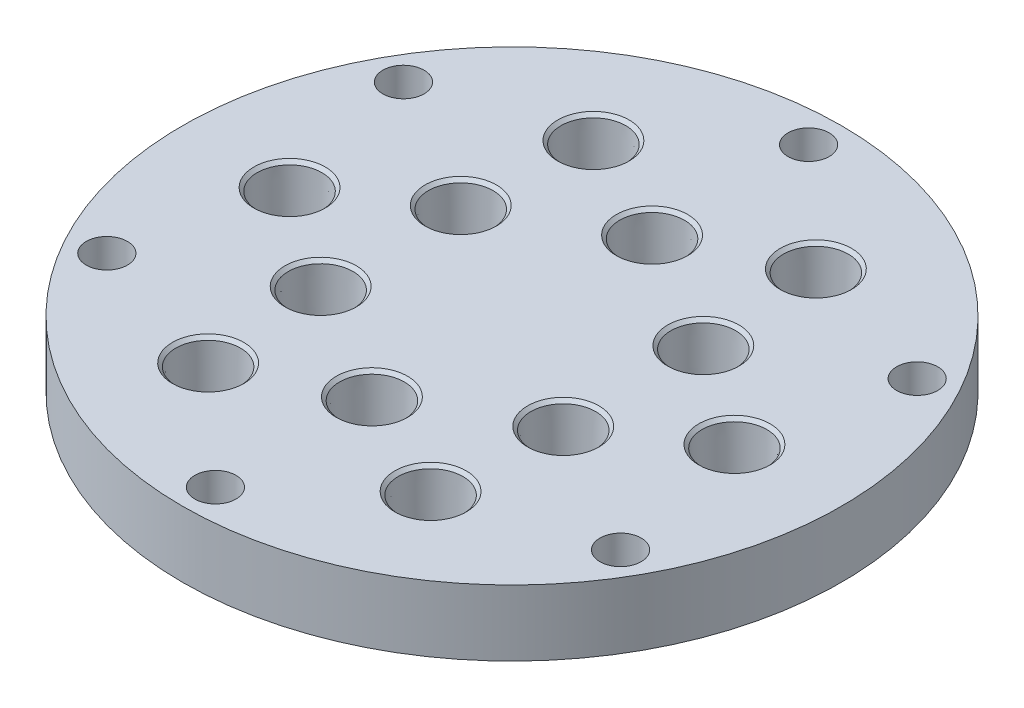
ISO-10303-21;
HEADER;
FILE_DESCRIPTION(('STEP AP214'),'2;1');
FILE_NAME('part.step','',(''),(''),'','','');
FILE_SCHEMA(('AUTOMOTIVE_DESIGN { 1 0 10303 214 1 1 1 1 }'));
ENDSEC;
DATA;
#1=APPLICATION_CONTEXT('core data for automotive mechanical design processes');
#2=APPLICATION_PROTOCOL_DEFINITION('international standard','automotive_design',2000,#1);
#3=PRODUCT_CONTEXT('',#1,'mechanical');
#4=PRODUCT('Part','Part','',(#3));
#5=PRODUCT_RELATED_PRODUCT_CATEGORY('part','',(#4));
#6=PRODUCT_DEFINITION_FORMATION('','',#4);
#7=PRODUCT_DEFINITION_CONTEXT('part definition',#1,'design');
#8=PRODUCT_DEFINITION('design','',#6,#7);
#9=PRODUCT_DEFINITION_SHAPE('','',#8);
#10=(LENGTH_UNIT() NAMED_UNIT(*) SI_UNIT(.MILLI.,.METRE.));
#11=(NAMED_UNIT(*) PLANE_ANGLE_UNIT() SI_UNIT($,.RADIAN.));
#12=(NAMED_UNIT(*) SI_UNIT($,.STERADIAN.) SOLID_ANGLE_UNIT());
#13=UNCERTAINTY_MEASURE_WITH_UNIT(LENGTH_MEASURE(1.E-05),#10,'distance_accuracy_value','');
#14=(GEOMETRIC_REPRESENTATION_CONTEXT(3) GLOBAL_UNCERTAINTY_ASSIGNED_CONTEXT((#13)) GLOBAL_UNIT_ASSIGNED_CONTEXT((#10,
#11,#12)) REPRESENTATION_CONTEXT('',''));
#15=CARTESIAN_POINT('',(0.,0.,0.));
#16=DIRECTION('',(0.,0.,1.));
#17=DIRECTION('',(1.,0.,0.));
#18=AXIS2_PLACEMENT_3D('',#15,#16,#17);
#19=CARTESIAN_POINT('',(0.,0.,0.));
#20=DIRECTION('',(0.,1.,0.));
#21=DIRECTION('',(0.,0.,1.));
#22=AXIS2_PLACEMENT_3D('',#19,#20,#21);
#23=PLANE('',#22);
#24=CARTESIAN_POINT('',(21.4312500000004,0.,37.1200138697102));
#25=DIRECTION('',(0.,1.,0.));
#26=DIRECTION('',(-0.866025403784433,0.,0.50000000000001));
#27=AXIS2_PLACEMENT_3D('',#24,#25,#26);
#28=CIRCLE('',#27,5.5626);
#29=CARTESIAN_POINT('',(16.6138970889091,0.,39.9013138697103));
#30=VERTEX_POINT('',#29);
#31=EDGE_CURVE('E306',#30,#30,#28,.T.);
#32=ORIENTED_EDGE('',*,*,#31,.T.);
#33=EDGE_LOOP('',(#32));
#34=FACE_BOUND('',#33,.T.);
#35=CARTESIAN_POINT('',(-21.4312499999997,0.,37.1200138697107));
#36=DIRECTION('',(0.,1.,0.));
#37=DIRECTION('',(-0.866025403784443,0.,-0.499999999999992));
#38=AXIS2_PLACEMENT_3D('',#35,#36,#37);
#39=CIRCLE('',#38,5.5626);
#40=CARTESIAN_POINT('',(-26.248602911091,0.,34.3387138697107));
#41=VERTEX_POINT('',#40);
#42=EDGE_CURVE('E321',#41,#41,#39,.T.);
#43=ORIENTED_EDGE('',*,*,#42,.T.);
#44=EDGE_LOOP('',(#43));
#45=FACE_BOUND('',#44,.T.);
#46=CARTESIAN_POINT('',(-42.8625,0.,2.99307411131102E-13));
#47=DIRECTION('',(0.,1.,0.));
#48=DIRECTION('',(0.,0.,-1.));
#49=AXIS2_PLACEMENT_3D('',#46,#47,#48);
#50=CIRCLE('',#49,5.5626);
#51=CARTESIAN_POINT('',(-42.8625,0.,-5.5625999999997));
#52=VERTEX_POINT('',#51);
#53=EDGE_CURVE('E336',#52,#52,#50,.T.);
#54=ORIENTED_EDGE('',*,*,#53,.T.);
#55=EDGE_LOOP('',(#54));
#56=FACE_BOUND('',#55,.T.);
#57=CARTESIAN_POINT('',(-21.4312500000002,0.,-37.1200138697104));
#58=DIRECTION('',(0.,1.,0.));
#59=DIRECTION('',(0.866025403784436,0.,-0.500000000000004));
#60=AXIS2_PLACEMENT_3D('',#57,#58,#59);
#61=CIRCLE('',#60,5.5626);
#62=CARTESIAN_POINT('',(-16.6138970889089,0.,-39.9013138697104));
#63=VERTEX_POINT('',#62);
#64=EDGE_CURVE('E351',#63,#63,#61,.T.);
#65=ORIENTED_EDGE('',*,*,#64,.T.);
#66=EDGE_LOOP('',(#65));
#67=FACE_BOUND('',#66,.T.);
#68=CARTESIAN_POINT('',(21.4312499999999,0.,-37.1200138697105));
#69=DIRECTION('',(0.,1.,0.));
#70=DIRECTION('',(0.86602540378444,0.,0.499999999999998));
#71=AXIS2_PLACEMENT_3D('',#68,#69,#70);
#72=CIRCLE('',#71,5.5626);
#73=CARTESIAN_POINT('',(26.2486029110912,0.,-34.3387138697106));
#74=VERTEX_POINT('',#73);
#75=EDGE_CURVE('E366',#74,#74,#72,.T.);
#76=ORIENTED_EDGE('',*,*,#75,.T.);
#77=EDGE_LOOP('',(#76));
#78=FACE_BOUND('',#77,.T.);
#79=CARTESIAN_POINT('',(-23.3718605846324,0.,13.4937500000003));
#80=DIRECTION('',(0.,1.,0.));
#81=DIRECTION('',(-0.866025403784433,0.,0.50000000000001));
#82=AXIS2_PLACEMENT_3D('',#79,#80,#81);
#83=CIRCLE('',#82,5.5626);
#84=CARTESIAN_POINT('',(-28.1892134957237,0.,16.2750500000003));
#85=VERTEX_POINT('',#84);
#86=EDGE_CURVE('E381',#85,#85,#83,.T.);
#87=ORIENTED_EDGE('',*,*,#86,.T.);
#88=EDGE_LOOP('',(#87));
#89=FACE_BOUND('',#88,.T.);
#90=CARTESIAN_POINT('',(-23.3718605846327,0.,-13.4937499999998));
#91=DIRECTION('',(0.,1.,0.));
#92=DIRECTION('',(-0.866025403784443,0.,-0.499999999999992));
#93=AXIS2_PLACEMENT_3D('',#90,#91,#92);
#94=CIRCLE('',#93,5.5626);
#95=CARTESIAN_POINT('',(-28.189213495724,0.,-16.2750499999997));
#96=VERTEX_POINT('',#95);
#97=EDGE_CURVE('E396',#96,#96,#94,.T.);
#98=ORIENTED_EDGE('',*,*,#97,.T.);
#99=EDGE_LOOP('',(#98));
#100=FACE_BOUND('',#99,.T.);
#101=CARTESIAN_POINT('',(-1.88452814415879E-13,0.,-26.9875));
#102=DIRECTION('',(0.,1.,0.));
#103=DIRECTION('',(0.,0.,-1.));
#104=AXIS2_PLACEMENT_3D('',#101,#102,#103);
#105=CIRCLE('',#104,5.5626);
#106=CARTESIAN_POINT('',(-2.27296265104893E-13,0.,-32.5501));
#107=VERTEX_POINT('',#106);
#108=EDGE_CURVE('E411',#107,#107,#105,.T.);
#109=ORIENTED_EDGE('',*,*,#108,.T.);
#110=EDGE_LOOP('',(#109));
#111=FACE_BOUND('',#110,.T.);
#112=CARTESIAN_POINT('',(23.3718605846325,0.,-13.4937500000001));
#113=DIRECTION('',(0.,1.,0.));
#114=DIRECTION('',(0.866025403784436,0.,-0.500000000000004));
#115=AXIS2_PLACEMENT_3D('',#112,#113,#114);
#116=CIRCLE('',#115,5.5626);
#117=CARTESIAN_POINT('',(28.1892134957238,0.,-16.2750500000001));
#118=VERTEX_POINT('',#117);
#119=EDGE_CURVE('E426',#118,#118,#116,.T.);
#120=ORIENTED_EDGE('',*,*,#119,.T.);
#121=EDGE_LOOP('',(#120));
#122=FACE_BOUND('',#121,.T.);
#123=CARTESIAN_POINT('',(23.3718605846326,0.,13.4937499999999));
#124=DIRECTION('',(0.,1.,0.));
#125=DIRECTION('',(0.86602540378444,0.,0.499999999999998));
#126=AXIS2_PLACEMENT_3D('',#123,#124,#125);
#127=CIRCLE('',#126,5.5626);
#128=CARTESIAN_POINT('',(28.1892134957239,0.,16.2750499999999));
#129=VERTEX_POINT('',#128);
#130=EDGE_CURVE('E441',#129,#129,#127,.T.);
#131=ORIENTED_EDGE('',*,*,#130,.T.);
#132=EDGE_LOOP('',(#131));
#133=FACE_BOUND('',#132,.T.);
#134=CARTESIAN_POINT('',(-49.4933518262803,0.,28.5750000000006));
#135=DIRECTION('',(0.,1.,0.));
#136=DIRECTION('',(-0.866025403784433,0.,0.50000000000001));
#137=AXIS2_PLACEMENT_3D('',#134,#135,#136);
#138=CIRCLE('',#137,3.96875);
#139=CARTESIAN_POINT('',(-52.9303901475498,0.,30.5593750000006));
#140=VERTEX_POINT('',#139);
#141=EDGE_CURVE('E453',#140,#140,#138,.T.);
#142=ORIENTED_EDGE('',*,*,#141,.T.);
#143=EDGE_LOOP('',(#142));
#144=FACE_BOUND('',#143,.T.);
#145=CARTESIAN_POINT('',(-49.4933518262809,0.,-28.5749999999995));
#146=DIRECTION('',(0.,1.,0.));
#147=DIRECTION('',(-0.866025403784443,0.,-0.499999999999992));
#148=AXIS2_PLACEMENT_3D('',#145,#146,#147);
#149=CIRCLE('',#148,3.96875);
#150=CARTESIAN_POINT('',(-52.9303901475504,0.,-30.5593749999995));
#151=VERTEX_POINT('',#150);
#152=EDGE_CURVE('E459',#151,#151,#149,.T.);
#153=ORIENTED_EDGE('',*,*,#152,.T.);
#154=EDGE_LOOP('',(#153));
#155=FACE_BOUND('',#154,.T.);
#156=CARTESIAN_POINT('',(-3.99076548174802E-13,0.,-57.15));
#157=DIRECTION('',(0.,1.,0.));
#158=DIRECTION('',(0.,0.,-1.));
#159=AXIS2_PLACEMENT_3D('',#156,#157,#158);
#160=CIRCLE('',#159,3.96875);
#161=CARTESIAN_POINT('',(-4.26790197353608E-13,0.,-61.11875));
#162=VERTEX_POINT('',#161);
#163=EDGE_CURVE('E465',#162,#162,#160,.T.);
#164=ORIENTED_EDGE('',*,*,#163,.T.);
#165=EDGE_LOOP('',(#164));
#166=FACE_BOUND('',#165,.T.);
#167=CARTESIAN_POINT('',(49.4933518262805,0.,-28.5750000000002));
#168=DIRECTION('',(0.,1.,0.));
#169=DIRECTION('',(0.866025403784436,0.,-0.500000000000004));
#170=AXIS2_PLACEMENT_3D('',#167,#168,#169);
#171=CIRCLE('',#170,3.96875);
#172=CARTESIAN_POINT('',(52.93039014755,0.,-30.5593750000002));
#173=VERTEX_POINT('',#172);
#174=EDGE_CURVE('E471',#173,#173,#171,.T.);
#175=ORIENTED_EDGE('',*,*,#174,.T.);
#176=EDGE_LOOP('',(#175));
#177=FACE_BOUND('',#176,.T.);
#178=CARTESIAN_POINT('',(49.4933518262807,0.,28.5749999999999));
#179=DIRECTION('',(0.,1.,0.));
#180=DIRECTION('',(0.86602540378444,0.,0.499999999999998));
#181=AXIS2_PLACEMENT_3D('',#178,#179,#180);
#182=CIRCLE('',#181,3.96875);
#183=CARTESIAN_POINT('',(52.9303901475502,0.,30.5593749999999));
#184=VERTEX_POINT('',#183);
#185=EDGE_CURVE('E477',#184,#184,#182,.T.);
#186=ORIENTED_EDGE('',*,*,#185,.T.);
#187=EDGE_LOOP('',(#186));
#188=FACE_BOUND('',#187,.T.);
#189=CARTESIAN_POINT('',(0.,0.,26.9875));
#190=DIRECTION('',(0.,1.,0.));
#191=DIRECTION('',(0.,0.,1.));
#192=AXIS2_PLACEMENT_3D('',#189,#190,#191);
#193=CIRCLE('',#192,5.5626);
#194=CARTESIAN_POINT('',(0.,0.,32.5501));
#195=VERTEX_POINT('',#194);
#196=EDGE_CURVE('E33',#195,#195,#193,.T.);
#197=ORIENTED_EDGE('',*,*,#196,.T.);
#198=EDGE_LOOP('',(#197));
#199=FACE_BOUND('',#198,.T.);
#200=CARTESIAN_POINT('',(42.8625,0.,0.));
#201=DIRECTION('',(0.,1.,0.));
#202=DIRECTION('',(0.,0.,1.));
#203=AXIS2_PLACEMENT_3D('',#200,#201,#202);
#204=CIRCLE('',#203,5.5626);
#205=CARTESIAN_POINT('',(42.8625,0.,5.5626));
#206=VERTEX_POINT('',#205);
#207=EDGE_CURVE('E45',#206,#206,#204,.T.);
#208=ORIENTED_EDGE('',*,*,#207,.T.);
#209=EDGE_LOOP('',(#208));
#210=FACE_BOUND('',#209,.T.);
#211=CARTESIAN_POINT('',(0.,0.,57.15));
#212=DIRECTION('',(0.,1.,0.));
#213=DIRECTION('',(0.,0.,1.));
#214=AXIS2_PLACEMENT_3D('',#211,#212,#213);
#215=CIRCLE('',#214,3.96875);
#216=CARTESIAN_POINT('',(0.,0.,61.11875));
#217=VERTEX_POINT('',#216);
#218=EDGE_CURVE('E42',#217,#217,#215,.T.);
#219=ORIENTED_EDGE('',*,*,#218,.T.);
#220=EDGE_LOOP('',(#219));
#221=FACE_BOUND('',#220,.T.);
#222=CARTESIAN_POINT('',(0.,0.,0.));
#223=DIRECTION('',(0.,1.,0.));
#224=DIRECTION('',(0.,0.,1.));
#225=AXIS2_PLACEMENT_3D('',#222,#223,#224);
#226=CIRCLE('',#225,63.5);
#227=CARTESIAN_POINT('',(0.,0.,63.5));
#228=VERTEX_POINT('',#227);
#229=EDGE_CURVE('E10',#228,#228,#226,.T.);
#230=ORIENTED_EDGE('',*,*,#229,.F.);
#231=EDGE_LOOP('',(#230));
#232=FACE_BOUND('',#231,.T.);
#233=ADVANCED_FACE('F30',(#34,#45,#56,#67,#78,#89,#100,#111,#122,#133,#144,#155,#166,#177,#188,
#199,#210,#221,#232),#23,.F.);
#234=CARTESIAN_POINT('',(0.,0.,0.));
#235=DIRECTION('',(0.,1.,0.));
#236=DIRECTION('',(0.,0.,1.));
#237=AXIS2_PLACEMENT_3D('',#234,#235,#236);
#238=CYLINDRICAL_SURFACE('',#237,63.5);
#239=CARTESIAN_POINT('',(0.,12.7,0.));
#240=DIRECTION('',(0.,1.,0.));
#241=DIRECTION('',(0.,0.,1.));
#242=AXIS2_PLACEMENT_3D('',#239,#240,#241);
#243=CIRCLE('',#242,63.5);
#244=CARTESIAN_POINT('',(0.,12.7,63.5));
#245=VERTEX_POINT('',#244);
#246=EDGE_CURVE('E37',#245,#245,#243,.T.);
#247=ORIENTED_EDGE('',*,*,#246,.F.);
#248=EDGE_LOOP('',(#247));
#249=FACE_BOUND('',#248,.T.);
#250=ORIENTED_EDGE('',*,*,#229,.T.);
#251=EDGE_LOOP('',(#250));
#252=FACE_BOUND('',#251,.T.);
#253=ADVANCED_FACE('F77',(#249,#252),#238,.T.);
#254=CARTESIAN_POINT('',(63.5,12.7,0.));
#255=DIRECTION('',(0.,-1.,0.));
#256=DIRECTION('',(0.,0.,-1.));
#257=AXIS2_PLACEMENT_3D('',#254,#255,#256);
#258=PLANE('',#257);
#259=CARTESIAN_POINT('',(21.4312500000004,12.7,37.1200138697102));
#260=DIRECTION('',(0.,1.,0.));
#261=DIRECTION('',(-0.866025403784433,0.,0.50000000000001));
#262=AXIS2_PLACEMENT_3D('',#259,#260,#261);
#263=CIRCLE('',#262,6.8752847);
#264=CARTESIAN_POINT('',(15.47707879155,12.7,40.5576562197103));
#265=VERTEX_POINT('',#264);
#266=EDGE_CURVE('E305',#265,#265,#263,.T.);
#267=ORIENTED_EDGE('',*,*,#266,.F.);
#268=EDGE_LOOP('',(#267));
#269=FACE_BOUND('',#268,.T.);
#270=CARTESIAN_POINT('',(-21.4312499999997,12.7,37.1200138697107));
#271=DIRECTION('',(0.,1.,0.));
#272=DIRECTION('',(-0.866025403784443,0.,-0.499999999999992));
#273=AXIS2_PLACEMENT_3D('',#270,#271,#272);
#274=CIRCLE('',#273,6.8752847);
#275=CARTESIAN_POINT('',(-27.3854212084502,12.7,33.6823715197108));
#276=VERTEX_POINT('',#275);
#277=EDGE_CURVE('E318',#276,#276,#274,.T.);
#278=ORIENTED_EDGE('',*,*,#277,.F.);
#279=EDGE_LOOP('',(#278));
#280=FACE_BOUND('',#279,.T.);
#281=CARTESIAN_POINT('',(-42.8625,12.7,2.99307411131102E-13));
#282=DIRECTION('',(0.,1.,0.));
#283=DIRECTION('',(0.,0.,-1.));
#284=AXIS2_PLACEMENT_3D('',#281,#282,#283);
#285=CIRCLE('',#284,6.8752847);
#286=CARTESIAN_POINT('',(-42.8625,12.7,-6.8752846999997));
#287=VERTEX_POINT('',#286);
#288=EDGE_CURVE('E333',#287,#287,#285,.T.);
#289=ORIENTED_EDGE('',*,*,#288,.F.);
#290=EDGE_LOOP('',(#289));
#291=FACE_BOUND('',#290,.T.);
#292=CARTESIAN_POINT('',(-21.4312500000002,12.7,-37.1200138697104));
#293=DIRECTION('',(0.,1.,0.));
#294=DIRECTION('',(0.866025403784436,0.,-0.500000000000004));
#295=AXIS2_PLACEMENT_3D('',#292,#293,#294);
#296=CIRCLE('',#295,6.8752847);
#297=CARTESIAN_POINT('',(-15.4770787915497,12.7,-40.5576562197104));
#298=VERTEX_POINT('',#297);
#299=EDGE_CURVE('E348',#298,#298,#296,.T.);
#300=ORIENTED_EDGE('',*,*,#299,.F.);
#301=EDGE_LOOP('',(#300));
#302=FACE_BOUND('',#301,.T.);
#303=CARTESIAN_POINT('',(21.4312499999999,12.7,-37.1200138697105));
#304=DIRECTION('',(0.,1.,0.));
#305=DIRECTION('',(0.86602540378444,0.,0.499999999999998));
#306=AXIS2_PLACEMENT_3D('',#303,#304,#305);
#307=CIRCLE('',#306,6.8752847);
#308=CARTESIAN_POINT('',(27.3854212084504,12.7,-33.6823715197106));
#309=VERTEX_POINT('',#308);
#310=EDGE_CURVE('E363',#309,#309,#307,.T.);
#311=ORIENTED_EDGE('',*,*,#310,.F.);
#312=EDGE_LOOP('',(#311));
#313=FACE_BOUND('',#312,.T.);
#314=CARTESIAN_POINT('',(-23.3718605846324,12.7,13.4937500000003));
#315=DIRECTION('',(0.,1.,0.));
#316=DIRECTION('',(-0.866025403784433,0.,0.50000000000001));
#317=AXIS2_PLACEMENT_3D('',#314,#315,#316);
#318=CIRCLE('',#317,6.8752847);
#319=CARTESIAN_POINT('',(-29.3260317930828,12.7,16.9313923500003));
#320=VERTEX_POINT('',#319);
#321=EDGE_CURVE('E378',#320,#320,#318,.T.);
#322=ORIENTED_EDGE('',*,*,#321,.F.);
#323=EDGE_LOOP('',(#322));
#324=FACE_BOUND('',#323,.T.);
#325=CARTESIAN_POINT('',(-23.3718605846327,12.7,-13.4937499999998));
#326=DIRECTION('',(0.,1.,0.));
#327=DIRECTION('',(-0.866025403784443,0.,-0.499999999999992));
#328=AXIS2_PLACEMENT_3D('',#325,#326,#327);
#329=CIRCLE('',#328,6.8752847);
#330=CARTESIAN_POINT('',(-29.3260317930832,12.7,-16.9313923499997));
#331=VERTEX_POINT('',#330);
#332=EDGE_CURVE('E393',#331,#331,#329,.T.);
#333=ORIENTED_EDGE('',*,*,#332,.F.);
#334=EDGE_LOOP('',(#333));
#335=FACE_BOUND('',#334,.T.);
#336=CARTESIAN_POINT('',(-1.88452814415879E-13,12.7,-26.9875));
#337=DIRECTION('',(0.,1.,0.));
#338=DIRECTION('',(0.,0.,-1.));
#339=AXIS2_PLACEMENT_3D('',#336,#337,#338);
#340=CIRCLE('',#339,6.8752847);
#341=CARTESIAN_POINT('',(-2.36462698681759E-13,12.7,-33.8627847));
#342=VERTEX_POINT('',#341);
#343=EDGE_CURVE('E408',#342,#342,#340,.T.);
#344=ORIENTED_EDGE('',*,*,#343,.F.);
#345=EDGE_LOOP('',(#344));
#346=FACE_BOUND('',#345,.T.);
#347=CARTESIAN_POINT('',(23.3718605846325,12.7,-13.4937500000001));
#348=DIRECTION('',(0.,1.,0.));
#349=DIRECTION('',(0.866025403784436,0.,-0.500000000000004));
#350=AXIS2_PLACEMENT_3D('',#347,#348,#349);
#351=CIRCLE('',#350,6.8752847);
#352=CARTESIAN_POINT('',(29.3260317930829,12.7,-16.9313923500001));
#353=VERTEX_POINT('',#352);
#354=EDGE_CURVE('E423',#353,#353,#351,.T.);
#355=ORIENTED_EDGE('',*,*,#354,.F.);
#356=EDGE_LOOP('',(#355));
#357=FACE_BOUND('',#356,.T.);
#358=CARTESIAN_POINT('',(23.3718605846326,12.7,13.4937499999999));
#359=DIRECTION('',(0.,1.,0.));
#360=DIRECTION('',(0.86602540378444,0.,0.499999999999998));
#361=AXIS2_PLACEMENT_3D('',#358,#359,#360);
#362=CIRCLE('',#361,6.8752847);
#363=CARTESIAN_POINT('',(29.326031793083,12.7,16.9313923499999));
#364=VERTEX_POINT('',#363);
#365=EDGE_CURVE('E438',#364,#364,#362,.T.);
#366=ORIENTED_EDGE('',*,*,#365,.F.);
#367=EDGE_LOOP('',(#366));
#368=FACE_BOUND('',#367,.T.);
#369=CARTESIAN_POINT('',(-49.4933518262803,12.7,28.5750000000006));
#370=DIRECTION('',(0.,1.,0.));
#371=DIRECTION('',(-0.866025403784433,0.,0.50000000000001));
#372=AXIS2_PLACEMENT_3D('',#369,#370,#371);
#373=CIRCLE('',#372,3.96874999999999);
#374=CARTESIAN_POINT('',(-52.9303901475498,12.7,30.5593750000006));
#375=VERTEX_POINT('',#374);
#376=EDGE_CURVE('E456',#375,#375,#373,.T.);
#377=ORIENTED_EDGE('',*,*,#376,.F.);
#378=EDGE_LOOP('',(#377));
#379=FACE_BOUND('',#378,.T.);
#380=CARTESIAN_POINT('',(-49.4933518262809,12.7,-28.5749999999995));
#381=DIRECTION('',(0.,1.,0.));
#382=DIRECTION('',(-0.866025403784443,0.,-0.499999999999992));
#383=AXIS2_PLACEMENT_3D('',#380,#381,#382);
#384=CIRCLE('',#383,3.96874999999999);
#385=CARTESIAN_POINT('',(-52.9303901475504,12.7,-30.5593749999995));
#386=VERTEX_POINT('',#385);
#387=EDGE_CURVE('E462',#386,#386,#384,.T.);
#388=ORIENTED_EDGE('',*,*,#387,.F.);
#389=EDGE_LOOP('',(#388));
#390=FACE_BOUND('',#389,.T.);
#391=CARTESIAN_POINT('',(-3.99076548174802E-13,12.7,-57.15));
#392=DIRECTION('',(0.,1.,0.));
#393=DIRECTION('',(0.,0.,-1.));
#394=AXIS2_PLACEMENT_3D('',#391,#392,#393);
#395=CIRCLE('',#394,3.96874999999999);
#396=CARTESIAN_POINT('',(-4.26790197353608E-13,12.7,-61.11875));
#397=VERTEX_POINT('',#396);
#398=EDGE_CURVE('E468',#397,#397,#395,.T.);
#399=ORIENTED_EDGE('',*,*,#398,.F.);
#400=EDGE_LOOP('',(#399));
#401=FACE_BOUND('',#400,.T.);
#402=CARTESIAN_POINT('',(49.4933518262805,12.7,-28.5750000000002));
#403=DIRECTION('',(0.,1.,0.));
#404=DIRECTION('',(0.866025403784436,0.,-0.500000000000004));
#405=AXIS2_PLACEMENT_3D('',#402,#403,#404);
#406=CIRCLE('',#405,3.96874999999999);
#407=CARTESIAN_POINT('',(52.93039014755,12.7,-30.5593750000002));
#408=VERTEX_POINT('',#407);
#409=EDGE_CURVE('E474',#408,#408,#406,.T.);
#410=ORIENTED_EDGE('',*,*,#409,.F.);
#411=EDGE_LOOP('',(#410));
#412=FACE_BOUND('',#411,.T.);
#413=CARTESIAN_POINT('',(49.4933518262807,12.7,28.5749999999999));
#414=DIRECTION('',(0.,1.,0.));
#415=DIRECTION('',(0.86602540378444,0.,0.499999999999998));
#416=AXIS2_PLACEMENT_3D('',#413,#414,#415);
#417=CIRCLE('',#416,3.96874999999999);
#418=CARTESIAN_POINT('',(52.9303901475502,12.7,30.5593749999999));
#419=VERTEX_POINT('',#418);
#420=EDGE_CURVE('E480',#419,#419,#417,.T.);
#421=ORIENTED_EDGE('',*,*,#420,.F.);
#422=EDGE_LOOP('',(#421));
#423=FACE_BOUND('',#422,.T.);
#424=CARTESIAN_POINT('',(0.,12.7,26.9875));
#425=DIRECTION('',(0.,1.,0.));
#426=DIRECTION('',(0.,0.,1.));
#427=AXIS2_PLACEMENT_3D('',#424,#425,#426);
#428=CIRCLE('',#427,6.8752847);
#429=CARTESIAN_POINT('',(0.,12.7,33.8627847));
#430=VERTEX_POINT('',#429);
#431=EDGE_CURVE('E483',#430,#430,#428,.T.);
#432=ORIENTED_EDGE('',*,*,#431,.F.);
#433=EDGE_LOOP('',(#432));
#434=FACE_BOUND('',#433,.T.);
#435=CARTESIAN_POINT('',(42.8625,12.7,0.));
#436=DIRECTION('',(0.,1.,0.));
#437=DIRECTION('',(0.,0.,1.));
#438=AXIS2_PLACEMENT_3D('',#435,#436,#437);
#439=CIRCLE('',#438,6.8752847);
#440=CARTESIAN_POINT('',(42.8625,12.7,6.8752847));
#441=VERTEX_POINT('',#440);
#442=EDGE_CURVE('E495',#441,#441,#439,.T.);
#443=ORIENTED_EDGE('',*,*,#442,.F.);
#444=EDGE_LOOP('',(#443));
#445=FACE_BOUND('',#444,.T.);
#446=CARTESIAN_POINT('',(0.,12.7,57.15));
#447=DIRECTION('',(0.,1.,0.));
#448=DIRECTION('',(0.,0.,1.));
#449=AXIS2_PLACEMENT_3D('',#446,#447,#448);
#450=CIRCLE('',#449,3.96874999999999);
#451=CARTESIAN_POINT('',(0.,12.7,61.11875));
#452=VERTEX_POINT('',#451);
#453=EDGE_CURVE('E47',#452,#452,#450,.T.);
#454=ORIENTED_EDGE('',*,*,#453,.F.);
#455=EDGE_LOOP('',(#454));
#456=FACE_BOUND('',#455,.T.);
#457=ORIENTED_EDGE('',*,*,#246,.T.);
#458=EDGE_LOOP('',(#457));
#459=FACE_BOUND('',#458,.T.);
#460=ADVANCED_FACE('F71',(#269,#280,#291,#302,#313,#324,#335,#346,#357,#368,#379,#390,#401,#412,
#423,#434,#445,#456,#459),#258,.F.);
#461=CARTESIAN_POINT('',(0.,12.7,57.15));
#462=DIRECTION('',(0.,1.,0.));
#463=DIRECTION('',(0.,0.,1.));
#464=AXIS2_PLACEMENT_3D('',#461,#462,#463);
#465=CYLINDRICAL_SURFACE('',#464,3.96874999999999);
#466=ORIENTED_EDGE('',*,*,#218,.F.);
#467=EDGE_LOOP('',(#466));
#468=FACE_BOUND('',#467,.T.);
#469=ORIENTED_EDGE('',*,*,#453,.T.);
#470=EDGE_LOOP('',(#469));
#471=FACE_BOUND('',#470,.T.);
#472=ADVANCED_FACE('F67',(#468,#471),#465,.F.);
#473=CARTESIAN_POINT('',(42.8625,12.7,0.));
#474=DIRECTION('',(0.,1.,0.));
#475=DIRECTION('',(0.,0.,1.));
#476=AXIS2_PLACEMENT_3D('',#473,#474,#475);
#477=CYLINDRICAL_SURFACE('',#476,5.5626);
#478=CARTESIAN_POINT('',(42.8625,2.794,0.));
#479=DIRECTION('',(0.,1.,0.));
#480=DIRECTION('',(0.,0.,1.));
#481=AXIS2_PLACEMENT_3D('',#478,#479,#480);
#482=CIRCLE('',#481,5.5626);
#483=CARTESIAN_POINT('',(42.8625,2.794,5.5626));
#484=VERTEX_POINT('',#483);
#485=EDGE_CURVE('E48',#484,#484,#482,.T.);
#486=ORIENTED_EDGE('',*,*,#485,.T.);
#487=EDGE_LOOP('',(#486));
#488=FACE_BOUND('',#487,.T.);
#489=ORIENTED_EDGE('',*,*,#207,.F.);
#490=EDGE_LOOP('',(#489));
#491=FACE_BOUND('',#490,.T.);
#492=ADVANCED_FACE('F70',(#488,#491),#477,.F.);
#493=CARTESIAN_POINT('',(48.4251,2.794,0.));
#494=DIRECTION('',(0.,-1.,0.));
#495=DIRECTION('',(0.,0.,-1.));
#496=AXIS2_PLACEMENT_3D('',#493,#494,#495);
#497=PLANE('',#496);
#498=ORIENTED_EDGE('',*,*,#485,.F.);
#499=EDGE_LOOP('',(#498));
#500=FACE_BOUND('',#499,.T.);
#501=CARTESIAN_POINT('',(42.8625,2.794,0.));
#502=DIRECTION('',(0.,1.,0.));
#503=DIRECTION('',(0.,0.,1.));
#504=AXIS2_PLACEMENT_3D('',#501,#502,#503);
#505=CIRCLE('',#504,5.96269854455);
#506=CARTESIAN_POINT('',(42.8625,2.794,5.96269854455));
#507=VERTEX_POINT('',#506);
#508=EDGE_CURVE('E54',#507,#507,#505,.T.);
#509=ORIENTED_EDGE('',*,*,#508,.T.);
#510=EDGE_LOOP('',(#509));
#511=FACE_BOUND('',#510,.T.);
#512=ADVANCED_FACE('F90',(#500,#511),#497,.F.);
#513=CARTESIAN_POINT('',(42.8625,12.065,0.));
#514=DIRECTION('',(0.,1.,0.));
#515=DIRECTION('',(0.,0.,1.));
#516=AXIS2_PLACEMENT_3D('',#513,#514,#515);
#517=CONICAL_SURFACE('',#516,6.2402847,0.029932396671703);
#518=ORIENTED_EDGE('',*,*,#508,.F.);
#519=EDGE_LOOP('',(#518));
#520=FACE_BOUND('',#519,.T.);
#521=CARTESIAN_POINT('',(42.8625,12.065,0.));
#522=DIRECTION('',(0.,1.,0.));
#523=DIRECTION('',(0.,0.,1.));
#524=AXIS2_PLACEMENT_3D('',#521,#522,#523);
#525=CIRCLE('',#524,6.2402847);
#526=CARTESIAN_POINT('',(42.8625,12.065,6.2402847));
#527=VERTEX_POINT('',#526);
#528=EDGE_CURVE('E59',#527,#527,#525,.T.);
#529=ORIENTED_EDGE('',*,*,#528,.T.);
#530=EDGE_LOOP('',(#529));
#531=FACE_BOUND('',#530,.T.);
#532=ADVANCED_FACE('F93',(#520,#531),#517,.F.);
#533=CARTESIAN_POINT('',(42.8625,12.7,0.));
#534=DIRECTION('',(0.,1.,0.));
#535=DIRECTION('',(0.,0.,1.));
#536=AXIS2_PLACEMENT_3D('',#533,#534,#535);
#537=CONICAL_SURFACE('',#536,6.8752847,0.785398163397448);
#538=ORIENTED_EDGE('',*,*,#528,.F.);
#539=EDGE_LOOP('',(#538));
#540=FACE_BOUND('',#539,.T.);
#541=ORIENTED_EDGE('',*,*,#442,.T.);
#542=EDGE_LOOP('',(#541));
#543=FACE_BOUND('',#542,.T.);
#544=ADVANCED_FACE('F97',(#540,#543),#537,.F.);
#545=CARTESIAN_POINT('',(0.,12.7,26.9875));
#546=DIRECTION('',(0.,1.,0.));
#547=DIRECTION('',(0.,0.,1.));
#548=AXIS2_PLACEMENT_3D('',#545,#546,#547);
#549=CYLINDRICAL_SURFACE('',#548,5.5626);
#550=CARTESIAN_POINT('',(0.,2.794,26.9875));
#551=DIRECTION('',(0.,1.,0.));
#552=DIRECTION('',(0.,0.,1.));
#553=AXIS2_PLACEMENT_3D('',#550,#551,#552);
#554=CIRCLE('',#553,5.5626);
#555=CARTESIAN_POINT('',(0.,2.794,32.5501));
#556=VERTEX_POINT('',#555);
#557=EDGE_CURVE('E492',#556,#556,#554,.T.);
#558=ORIENTED_EDGE('',*,*,#557,.T.);
#559=EDGE_LOOP('',(#558));
#560=FACE_BOUND('',#559,.T.);
#561=ORIENTED_EDGE('',*,*,#196,.F.);
#562=EDGE_LOOP('',(#561));
#563=FACE_BOUND('',#562,.T.);
#564=ADVANCED_FACE('F101',(#560,#563),#549,.F.);
#565=CARTESIAN_POINT('',(5.5626,2.794,26.9875));
#566=DIRECTION('',(0.,-1.,0.));
#567=DIRECTION('',(0.,0.,-1.));
#568=AXIS2_PLACEMENT_3D('',#565,#566,#567);
#569=PLANE('',#568);
#570=ORIENTED_EDGE('',*,*,#557,.F.);
#571=EDGE_LOOP('',(#570));
#572=FACE_BOUND('',#571,.T.);
#573=CARTESIAN_POINT('',(0.,2.794,26.9875));
#574=DIRECTION('',(0.,1.,0.));
#575=DIRECTION('',(0.,0.,1.));
#576=AXIS2_PLACEMENT_3D('',#573,#574,#575);
#577=CIRCLE('',#576,5.96269854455);
#578=CARTESIAN_POINT('',(0.,2.794,32.95019854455));
#579=VERTEX_POINT('',#578);
#580=EDGE_CURVE('E489',#579,#579,#577,.T.);
#581=ORIENTED_EDGE('',*,*,#580,.T.);
#582=EDGE_LOOP('',(#581));
#583=FACE_BOUND('',#582,.T.);
#584=ADVANCED_FACE('F105',(#572,#583),#569,.F.);
#585=CARTESIAN_POINT('',(0.,12.065,26.9875));
#586=DIRECTION('',(0.,1.,0.));
#587=DIRECTION('',(0.,0.,1.));
#588=AXIS2_PLACEMENT_3D('',#585,#586,#587);
#589=CONICAL_SURFACE('',#588,6.2402847,0.029932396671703);
#590=ORIENTED_EDGE('',*,*,#580,.F.);
#591=EDGE_LOOP('',(#590));
#592=FACE_BOUND('',#591,.T.);
#593=CARTESIAN_POINT('',(0.,12.065,26.9875));
#594=DIRECTION('',(0.,1.,0.));
#595=DIRECTION('',(0.,0.,1.));
#596=AXIS2_PLACEMENT_3D('',#593,#594,#595);
#597=CIRCLE('',#596,6.2402847);
#598=CARTESIAN_POINT('',(0.,12.065,33.2277847));
#599=VERTEX_POINT('',#598);
#600=EDGE_CURVE('E486',#599,#599,#597,.T.);
#601=ORIENTED_EDGE('',*,*,#600,.T.);
#602=EDGE_LOOP('',(#601));
#603=FACE_BOUND('',#602,.T.);
#604=ADVANCED_FACE('F109',(#592,#603),#589,.F.);
#605=CARTESIAN_POINT('',(0.,12.7,26.9875));
#606=DIRECTION('',(0.,1.,0.));
#607=DIRECTION('',(0.,0.,1.));
#608=AXIS2_PLACEMENT_3D('',#605,#606,#607);
#609=CONICAL_SURFACE('',#608,6.8752847,0.785398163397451);
#610=ORIENTED_EDGE('',*,*,#600,.F.);
#611=EDGE_LOOP('',(#610));
#612=FACE_BOUND('',#611,.T.);
#613=ORIENTED_EDGE('',*,*,#431,.T.);
#614=EDGE_LOOP('',(#613));
#615=FACE_BOUND('',#614,.T.);
#616=ADVANCED_FACE('F113',(#612,#615),#609,.F.);
#617=CARTESIAN_POINT('',(49.4933518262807,12.7,28.5749999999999));
#618=DIRECTION('',(0.,1.,0.));
#619=DIRECTION('',(0.86602540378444,0.,0.499999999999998));
#620=AXIS2_PLACEMENT_3D('',#617,#618,#619);
#621=CYLINDRICAL_SURFACE('',#620,3.96874999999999);
#622=ORIENTED_EDGE('',*,*,#185,.F.);
#623=EDGE_LOOP('',(#622));
#624=FACE_BOUND('',#623,.T.);
#625=ORIENTED_EDGE('',*,*,#420,.T.);
#626=EDGE_LOOP('',(#625));
#627=FACE_BOUND('',#626,.T.);
#628=ADVANCED_FACE('F117',(#624,#627),#621,.F.);
#629=CARTESIAN_POINT('',(49.4933518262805,12.7,-28.5750000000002));
#630=DIRECTION('',(0.,1.,0.));
#631=DIRECTION('',(0.866025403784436,0.,-0.500000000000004));
#632=AXIS2_PLACEMENT_3D('',#629,#630,#631);
#633=CYLINDRICAL_SURFACE('',#632,3.96874999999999);
#634=ORIENTED_EDGE('',*,*,#174,.F.);
#635=EDGE_LOOP('',(#634));
#636=FACE_BOUND('',#635,.T.);
#637=ORIENTED_EDGE('',*,*,#409,.T.);
#638=EDGE_LOOP('',(#637));
#639=FACE_BOUND('',#638,.T.);
#640=ADVANCED_FACE('F121',(#636,#639),#633,.F.);
#641=CARTESIAN_POINT('',(-3.99076548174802E-13,12.7,-57.15));
#642=DIRECTION('',(0.,1.,0.));
#643=DIRECTION('',(0.,0.,-1.));
#644=AXIS2_PLACEMENT_3D('',#641,#642,#643);
#645=CYLINDRICAL_SURFACE('',#644,3.96874999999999);
#646=ORIENTED_EDGE('',*,*,#163,.F.);
#647=EDGE_LOOP('',(#646));
#648=FACE_BOUND('',#647,.T.);
#649=ORIENTED_EDGE('',*,*,#398,.T.);
#650=EDGE_LOOP('',(#649));
#651=FACE_BOUND('',#650,.T.);
#652=ADVANCED_FACE('F125',(#648,#651),#645,.F.);
#653=CARTESIAN_POINT('',(-49.4933518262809,12.7,-28.5749999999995));
#654=DIRECTION('',(0.,1.,0.));
#655=DIRECTION('',(-0.866025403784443,0.,-0.499999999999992));
#656=AXIS2_PLACEMENT_3D('',#653,#654,#655);
#657=CYLINDRICAL_SURFACE('',#656,3.96874999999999);
#658=ORIENTED_EDGE('',*,*,#152,.F.);
#659=EDGE_LOOP('',(#658));
#660=FACE_BOUND('',#659,.T.);
#661=ORIENTED_EDGE('',*,*,#387,.T.);
#662=EDGE_LOOP('',(#661));
#663=FACE_BOUND('',#662,.T.);
#664=ADVANCED_FACE('F129',(#660,#663),#657,.F.);
#665=CARTESIAN_POINT('',(-49.4933518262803,12.7,28.5750000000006));
#666=DIRECTION('',(0.,1.,0.));
#667=DIRECTION('',(-0.866025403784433,0.,0.50000000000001));
#668=AXIS2_PLACEMENT_3D('',#665,#666,#667);
#669=CYLINDRICAL_SURFACE('',#668,3.96874999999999);
#670=ORIENTED_EDGE('',*,*,#141,.F.);
#671=EDGE_LOOP('',(#670));
#672=FACE_BOUND('',#671,.T.);
#673=ORIENTED_EDGE('',*,*,#376,.T.);
#674=EDGE_LOOP('',(#673));
#675=FACE_BOUND('',#674,.T.);
#676=ADVANCED_FACE('F133',(#672,#675),#669,.F.);
#677=CARTESIAN_POINT('',(23.3718605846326,12.7,13.4937499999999));
#678=DIRECTION('',(0.,1.,0.));
#679=DIRECTION('',(0.86602540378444,0.,0.499999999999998));
#680=AXIS2_PLACEMENT_3D('',#677,#678,#679);
#681=CYLINDRICAL_SURFACE('',#680,5.5626);
#682=CARTESIAN_POINT('',(23.3718605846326,2.794,13.4937499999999));
#683=DIRECTION('',(0.,1.,0.));
#684=DIRECTION('',(0.86602540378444,0.,0.499999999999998));
#685=AXIS2_PLACEMENT_3D('',#682,#683,#684);
#686=CIRCLE('',#685,5.5626);
#687=CARTESIAN_POINT('',(28.1892134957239,2.794,16.2750499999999));
#688=VERTEX_POINT('',#687);
#689=EDGE_CURVE('E450',#688,#688,#686,.T.);
#690=ORIENTED_EDGE('',*,*,#689,.T.);
#691=EDGE_LOOP('',(#690));
#692=FACE_BOUND('',#691,.T.);
#693=ORIENTED_EDGE('',*,*,#130,.F.);
#694=EDGE_LOOP('',(#693));
#695=FACE_BOUND('',#694,.T.);
#696=ADVANCED_FACE('F137',(#692,#695),#681,.F.);
#697=CARTESIAN_POINT('',(26.1531605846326,2.794,8.67639708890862));
#698=DIRECTION('',(0.,-1.,0.));
#699=DIRECTION('',(-0.86602540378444,0.,-0.499999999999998));
#700=AXIS2_PLACEMENT_3D('',#697,#698,#699);
#701=PLANE('',#700);
#702=ORIENTED_EDGE('',*,*,#689,.F.);
#703=EDGE_LOOP('',(#702));
#704=FACE_BOUND('',#703,.T.);
#705=CARTESIAN_POINT('',(23.3718605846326,2.794,13.4937499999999));
#706=DIRECTION('',(0.,1.,0.));
#707=DIRECTION('',(0.86602540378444,0.,0.499999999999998));
#708=AXIS2_PLACEMENT_3D('',#705,#706,#707);
#709=CIRCLE('',#708,5.96269854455);
#710=CARTESIAN_POINT('',(28.5357089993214,2.794,16.4750992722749));
#711=VERTEX_POINT('',#710);
#712=EDGE_CURVE('E447',#711,#711,#709,.T.);
#713=ORIENTED_EDGE('',*,*,#712,.T.);
#714=EDGE_LOOP('',(#713));
#715=FACE_BOUND('',#714,.T.);
#716=ADVANCED_FACE('F142',(#704,#715),#701,.F.);
#717=CARTESIAN_POINT('',(23.3718605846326,12.065,13.4937499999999));
#718=DIRECTION('',(0.,1.,0.));
#719=DIRECTION('',(0.86602540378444,0.,0.499999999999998));
#720=AXIS2_PLACEMENT_3D('',#717,#718,#719);
#721=CONICAL_SURFACE('',#720,6.2402847,0.029932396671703);
#722=ORIENTED_EDGE('',*,*,#712,.F.);
#723=EDGE_LOOP('',(#722));
#724=FACE_BOUND('',#723,.T.);
#725=CARTESIAN_POINT('',(23.3718605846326,12.065,13.4937499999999));
#726=DIRECTION('',(0.,1.,0.));
#727=DIRECTION('',(0.86602540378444,0.,0.499999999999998));
#728=AXIS2_PLACEMENT_3D('',#725,#726,#727);
#729=CIRCLE('',#728,6.2402847);
#730=CARTESIAN_POINT('',(28.7761056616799,12.065,16.6138923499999));
#731=VERTEX_POINT('',#730);
#732=EDGE_CURVE('E444',#731,#731,#729,.T.);
#733=ORIENTED_EDGE('',*,*,#732,.T.);
#734=EDGE_LOOP('',(#733));
#735=FACE_BOUND('',#734,.T.);
#736=ADVANCED_FACE('F147',(#724,#735),#721,.F.);
#737=CARTESIAN_POINT('',(23.3718605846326,12.7,13.4937499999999));
#738=DIRECTION('',(0.,1.,0.));
#739=DIRECTION('',(0.86602540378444,0.,0.499999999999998));
#740=AXIS2_PLACEMENT_3D('',#737,#738,#739);
#741=CONICAL_SURFACE('',#740,6.8752847,0.785398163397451);
#742=ORIENTED_EDGE('',*,*,#732,.F.);
#743=EDGE_LOOP('',(#742));
#744=FACE_BOUND('',#743,.T.);
#745=ORIENTED_EDGE('',*,*,#365,.T.);
#746=EDGE_LOOP('',(#745));
#747=FACE_BOUND('',#746,.T.);
#748=ADVANCED_FACE('F139',(#744,#747),#741,.F.);
#749=CARTESIAN_POINT('',(23.3718605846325,12.7,-13.4937500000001));
#750=DIRECTION('',(0.,1.,0.));
#751=DIRECTION('',(0.866025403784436,0.,-0.500000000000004));
#752=AXIS2_PLACEMENT_3D('',#749,#750,#751);
#753=CYLINDRICAL_SURFACE('',#752,5.5626);
#754=CARTESIAN_POINT('',(23.3718605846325,2.794,-13.4937500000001));
#755=DIRECTION('',(0.,1.,0.));
#756=DIRECTION('',(0.866025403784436,0.,-0.500000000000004));
#757=AXIS2_PLACEMENT_3D('',#754,#755,#756);
#758=CIRCLE('',#757,5.5626);
#759=CARTESIAN_POINT('',(28.1892134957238,2.794,-16.2750500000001));
#760=VERTEX_POINT('',#759);
#761=EDGE_CURVE('E435',#760,#760,#758,.T.);
#762=ORIENTED_EDGE('',*,*,#761,.T.);
#763=EDGE_LOOP('',(#762));
#764=FACE_BOUND('',#763,.T.);
#765=ORIENTED_EDGE('',*,*,#119,.F.);
#766=EDGE_LOOP('',(#765));
#767=FACE_BOUND('',#766,.T.);
#768=ADVANCED_FACE('F154',(#764,#767),#753,.F.);
#769=CARTESIAN_POINT('',(20.5905605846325,2.794,-18.3111029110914));
#770=DIRECTION('',(0.,-1.,0.));
#771=DIRECTION('',(-0.866025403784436,0.,0.500000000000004));
#772=AXIS2_PLACEMENT_3D('',#769,#770,#771);
#773=PLANE('',#772);
#774=ORIENTED_EDGE('',*,*,#761,.F.);
#775=EDGE_LOOP('',(#774));
#776=FACE_BOUND('',#775,.T.);
#777=CARTESIAN_POINT('',(23.3718605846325,2.794,-13.4937500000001));
#778=DIRECTION('',(0.,1.,0.));
#779=DIRECTION('',(0.866025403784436,0.,-0.500000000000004));
#780=AXIS2_PLACEMENT_3D('',#777,#778,#779);
#781=CIRCLE('',#780,5.96269854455);
#782=CARTESIAN_POINT('',(28.5357089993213,2.794,-16.4750992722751));
#783=VERTEX_POINT('',#782);
#784=EDGE_CURVE('E432',#783,#783,#781,.T.);
#785=ORIENTED_EDGE('',*,*,#784,.T.);
#786=EDGE_LOOP('',(#785));
#787=FACE_BOUND('',#786,.T.);
#788=ADVANCED_FACE('F158',(#776,#787),#773,.F.);
#789=CARTESIAN_POINT('',(23.3718605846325,12.065,-13.4937500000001));
#790=DIRECTION('',(0.,1.,0.));
#791=DIRECTION('',(0.866025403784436,0.,-0.500000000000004));
#792=AXIS2_PLACEMENT_3D('',#789,#790,#791);
#793=CONICAL_SURFACE('',#792,6.2402847,0.029932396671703);
#794=ORIENTED_EDGE('',*,*,#784,.F.);
#795=EDGE_LOOP('',(#794));
#796=FACE_BOUND('',#795,.T.);
#797=CARTESIAN_POINT('',(23.3718605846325,12.065,-13.4937500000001));
#798=DIRECTION('',(0.,1.,0.));
#799=DIRECTION('',(0.866025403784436,0.,-0.500000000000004));
#800=AXIS2_PLACEMENT_3D('',#797,#798,#799);
#801=CIRCLE('',#800,6.2402847);
#802=CARTESIAN_POINT('',(28.7761056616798,12.065,-16.6138923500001));
#803=VERTEX_POINT('',#802);
#804=EDGE_CURVE('E429',#803,#803,#801,.T.);
#805=ORIENTED_EDGE('',*,*,#804,.T.);
#806=EDGE_LOOP('',(#805));
#807=FACE_BOUND('',#806,.T.);
#808=ADVANCED_FACE('F163',(#796,#807),#793,.F.);
#809=CARTESIAN_POINT('',(23.3718605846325,12.7,-13.4937500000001));
#810=DIRECTION('',(0.,1.,0.));
#811=DIRECTION('',(0.866025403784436,0.,-0.500000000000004));
#812=AXIS2_PLACEMENT_3D('',#809,#810,#811);
#813=CONICAL_SURFACE('',#812,6.8752847,0.785398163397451);
#814=ORIENTED_EDGE('',*,*,#804,.F.);
#815=EDGE_LOOP('',(#814));
#816=FACE_BOUND('',#815,.T.);
#817=ORIENTED_EDGE('',*,*,#354,.T.);
#818=EDGE_LOOP('',(#817));
#819=FACE_BOUND('',#818,.T.);
#820=ADVANCED_FACE('F144',(#816,#819),#813,.F.);
#821=CARTESIAN_POINT('',(-1.88452814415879E-13,12.7,-26.9875));
#822=DIRECTION('',(0.,1.,0.));
#823=DIRECTION('',(0.,0.,-1.));
#824=AXIS2_PLACEMENT_3D('',#821,#822,#823);
#825=CYLINDRICAL_SURFACE('',#824,5.5626);
#826=CARTESIAN_POINT('',(-1.88452814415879E-13,2.794,-26.9875));
#827=DIRECTION('',(0.,1.,0.));
#828=DIRECTION('',(0.,0.,-1.));
#829=AXIS2_PLACEMENT_3D('',#826,#827,#828);
#830=CIRCLE('',#829,5.5626);
#831=CARTESIAN_POINT('',(-2.27296265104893E-13,2.794,-32.5501));
#832=VERTEX_POINT('',#831);
#833=EDGE_CURVE('E420',#832,#832,#830,.T.);
#834=ORIENTED_EDGE('',*,*,#833,.T.);
#835=EDGE_LOOP('',(#834));
#836=FACE_BOUND('',#835,.T.);
#837=ORIENTED_EDGE('',*,*,#108,.F.);
#838=EDGE_LOOP('',(#837));
#839=FACE_BOUND('',#838,.T.);
#840=ADVANCED_FACE('F170',(#836,#839),#825,.F.);
#841=CARTESIAN_POINT('',(-5.56260000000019,2.794,-26.9875));
#842=DIRECTION('',(0.,-1.,0.));
#843=DIRECTION('',(0.,0.,1.));
#844=AXIS2_PLACEMENT_3D('',#841,#842,#843);
#845=PLANE('',#844);
#846=ORIENTED_EDGE('',*,*,#833,.F.);
#847=EDGE_LOOP('',(#846));
#848=FACE_BOUND('',#847,.T.);
#849=CARTESIAN_POINT('',(-1.88452814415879E-13,2.794,-26.9875));
#850=DIRECTION('',(0.,1.,0.));
#851=DIRECTION('',(0.,0.,-1.));
#852=AXIS2_PLACEMENT_3D('',#849,#850,#851);
#853=CIRCLE('',#852,5.96269854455);
#854=CARTESIAN_POINT('',(-2.30090139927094E-13,2.794,-32.95019854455));
#855=VERTEX_POINT('',#854);
#856=EDGE_CURVE('E417',#855,#855,#853,.T.);
#857=ORIENTED_EDGE('',*,*,#856,.T.);
#858=EDGE_LOOP('',(#857));
#859=FACE_BOUND('',#858,.T.);
#860=ADVANCED_FACE('F174',(#848,#859),#845,.F.);
#861=CARTESIAN_POINT('',(-1.88452814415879E-13,12.065,-26.9875));
#862=DIRECTION('',(0.,1.,0.));
#863=DIRECTION('',(0.,0.,-1.));
#864=AXIS2_PLACEMENT_3D('',#861,#862,#863);
#865=CONICAL_SURFACE('',#864,6.2402847,0.029932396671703);
#866=ORIENTED_EDGE('',*,*,#856,.F.);
#867=EDGE_LOOP('',(#866));
#868=FACE_BOUND('',#867,.T.);
#869=CARTESIAN_POINT('',(-1.88452814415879E-13,12.065,-26.9875));
#870=DIRECTION('',(0.,1.,0.));
#871=DIRECTION('',(0.,0.,-1.));
#872=AXIS2_PLACEMENT_3D('',#869,#870,#871);
#873=CIRCLE('',#872,6.2402847);
#874=CARTESIAN_POINT('',(-2.3202851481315E-13,12.065,-33.2277847));
#875=VERTEX_POINT('',#874);
#876=EDGE_CURVE('E414',#875,#875,#873,.T.);
#877=ORIENTED_EDGE('',*,*,#876,.T.);
#878=EDGE_LOOP('',(#877));
#879=FACE_BOUND('',#878,.T.);
#880=ADVANCED_FACE('F179',(#868,#879),#865,.F.);
#881=CARTESIAN_POINT('',(-1.88452814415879E-13,12.7,-26.9875));
#882=DIRECTION('',(0.,1.,0.));
#883=DIRECTION('',(0.,0.,-1.));
#884=AXIS2_PLACEMENT_3D('',#881,#882,#883);
#885=CONICAL_SURFACE('',#884,6.8752847,0.785398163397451);
#886=ORIENTED_EDGE('',*,*,#876,.F.);
#887=EDGE_LOOP('',(#886));
#888=FACE_BOUND('',#887,.T.);
#889=ORIENTED_EDGE('',*,*,#343,.T.);
#890=EDGE_LOOP('',(#889));
#891=FACE_BOUND('',#890,.T.);
#892=ADVANCED_FACE('F160',(#888,#891),#885,.F.);
#893=CARTESIAN_POINT('',(-23.3718605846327,12.7,-13.4937499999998));
#894=DIRECTION('',(0.,1.,0.));
#895=DIRECTION('',(-0.866025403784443,0.,-0.499999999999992));
#896=AXIS2_PLACEMENT_3D('',#893,#894,#895);
#897=CYLINDRICAL_SURFACE('',#896,5.5626);
#898=CARTESIAN_POINT('',(-23.3718605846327,2.794,-13.4937499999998));
#899=DIRECTION('',(0.,1.,0.));
#900=DIRECTION('',(-0.866025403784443,0.,-0.499999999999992));
#901=AXIS2_PLACEMENT_3D('',#898,#899,#900);
#902=CIRCLE('',#901,5.5626);
#903=CARTESIAN_POINT('',(-28.189213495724,2.794,-16.2750499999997));
#904=VERTEX_POINT('',#903);
#905=EDGE_CURVE('E405',#904,#904,#902,.T.);
#906=ORIENTED_EDGE('',*,*,#905,.T.);
#907=EDGE_LOOP('',(#906));
#908=FACE_BOUND('',#907,.T.);
#909=ORIENTED_EDGE('',*,*,#97,.F.);
#910=EDGE_LOOP('',(#909));
#911=FACE_BOUND('',#910,.T.);
#912=ADVANCED_FACE('F186',(#908,#911),#897,.F.);
#913=CARTESIAN_POINT('',(-26.1531605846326,2.794,-8.67639708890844));
#914=DIRECTION('',(0.,-1.,0.));
#915=DIRECTION('',(0.866025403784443,0.,0.499999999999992));
#916=AXIS2_PLACEMENT_3D('',#913,#914,#915);
#917=PLANE('',#916);
#918=ORIENTED_EDGE('',*,*,#905,.F.);
#919=EDGE_LOOP('',(#918));
#920=FACE_BOUND('',#919,.T.);
#921=CARTESIAN_POINT('',(-23.3718605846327,2.794,-13.4937499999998));
#922=DIRECTION('',(0.,1.,0.));
#923=DIRECTION('',(-0.866025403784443,0.,-0.499999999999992));
#924=AXIS2_PLACEMENT_3D('',#921,#922,#923);
#925=CIRCLE('',#924,5.96269854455);
#926=CARTESIAN_POINT('',(-28.5357089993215,2.794,-16.4750992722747));
#927=VERTEX_POINT('',#926);
#928=EDGE_CURVE('E402',#927,#927,#925,.T.);
#929=ORIENTED_EDGE('',*,*,#928,.T.);
#930=EDGE_LOOP('',(#929));
#931=FACE_BOUND('',#930,.T.);
#932=ADVANCED_FACE('F190',(#920,#931),#917,.F.);
#933=CARTESIAN_POINT('',(-23.3718605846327,12.065,-13.4937499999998));
#934=DIRECTION('',(0.,1.,0.));
#935=DIRECTION('',(-0.866025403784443,0.,-0.499999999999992));
#936=AXIS2_PLACEMENT_3D('',#933,#934,#935);
#937=CONICAL_SURFACE('',#936,6.2402847,0.029932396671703);
#938=ORIENTED_EDGE('',*,*,#928,.F.);
#939=EDGE_LOOP('',(#938));
#940=FACE_BOUND('',#939,.T.);
#941=CARTESIAN_POINT('',(-23.3718605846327,12.065,-13.4937499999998));
#942=DIRECTION('',(0.,1.,0.));
#943=DIRECTION('',(-0.866025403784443,0.,-0.499999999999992));
#944=AXIS2_PLACEMENT_3D('',#941,#942,#943);
#945=CIRCLE('',#944,6.2402847);
#946=CARTESIAN_POINT('',(-28.77610566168,12.065,-16.6138923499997));
#947=VERTEX_POINT('',#946);
#948=EDGE_CURVE('E399',#947,#947,#945,.T.);
#949=ORIENTED_EDGE('',*,*,#948,.T.);
#950=EDGE_LOOP('',(#949));
#951=FACE_BOUND('',#950,.T.);
#952=ADVANCED_FACE('F195',(#940,#951),#937,.F.);
#953=CARTESIAN_POINT('',(-23.3718605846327,12.7,-13.4937499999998));
#954=DIRECTION('',(0.,1.,0.));
#955=DIRECTION('',(-0.866025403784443,0.,-0.499999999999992));
#956=AXIS2_PLACEMENT_3D('',#953,#954,#955);
#957=CONICAL_SURFACE('',#956,6.8752847,0.785398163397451);
#958=ORIENTED_EDGE('',*,*,#948,.F.);
#959=EDGE_LOOP('',(#958));
#960=FACE_BOUND('',#959,.T.);
#961=ORIENTED_EDGE('',*,*,#332,.T.);
#962=EDGE_LOOP('',(#961));
#963=FACE_BOUND('',#962,.T.);
#964=ADVANCED_FACE('F176',(#960,#963),#957,.F.);
#965=CARTESIAN_POINT('',(-23.3718605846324,12.7,13.4937500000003));
#966=DIRECTION('',(0.,1.,0.));
#967=DIRECTION('',(-0.866025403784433,0.,0.50000000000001));
#968=AXIS2_PLACEMENT_3D('',#965,#966,#967);
#969=CYLINDRICAL_SURFACE('',#968,5.5626);
#970=CARTESIAN_POINT('',(-23.3718605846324,2.794,13.4937500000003));
#971=DIRECTION('',(0.,1.,0.));
#972=DIRECTION('',(-0.866025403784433,0.,0.50000000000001));
#973=AXIS2_PLACEMENT_3D('',#970,#971,#972);
#974=CIRCLE('',#973,5.5626);
#975=CARTESIAN_POINT('',(-28.1892134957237,2.794,16.2750500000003));
#976=VERTEX_POINT('',#975);
#977=EDGE_CURVE('E390',#976,#976,#974,.T.);
#978=ORIENTED_EDGE('',*,*,#977,.T.);
#979=EDGE_LOOP('',(#978));
#980=FACE_BOUND('',#979,.T.);
#981=ORIENTED_EDGE('',*,*,#86,.F.);
#982=EDGE_LOOP('',(#981));
#983=FACE_BOUND('',#982,.T.);
#984=ADVANCED_FACE('F202',(#980,#983),#969,.F.);
#985=CARTESIAN_POINT('',(-20.5905605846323,2.794,18.3111029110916));
#986=DIRECTION('',(0.,-1.,0.));
#987=DIRECTION('',(0.866025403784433,0.,-0.50000000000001));
#988=AXIS2_PLACEMENT_3D('',#985,#986,#987);
#989=PLANE('',#988);
#990=ORIENTED_EDGE('',*,*,#977,.F.);
#991=EDGE_LOOP('',(#990));
#992=FACE_BOUND('',#991,.T.);
#993=CARTESIAN_POINT('',(-23.3718605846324,2.794,13.4937500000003));
#994=DIRECTION('',(0.,1.,0.));
#995=DIRECTION('',(-0.866025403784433,0.,0.50000000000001));
#996=AXIS2_PLACEMENT_3D('',#993,#994,#995);
#997=CIRCLE('',#996,5.96269854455);
#998=CARTESIAN_POINT('',(-28.5357089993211,2.794,16.4750992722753));
#999=VERTEX_POINT('',#998);
#1000=EDGE_CURVE('E387',#999,#999,#997,.T.);
#1001=ORIENTED_EDGE('',*,*,#1000,.T.);
#1002=EDGE_LOOP('',(#1001));
#1003=FACE_BOUND('',#1002,.T.);
#1004=ADVANCED_FACE('F206',(#992,#1003),#989,.F.);
#1005=CARTESIAN_POINT('',(-23.3718605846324,12.065,13.4937500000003));
#1006=DIRECTION('',(0.,1.,0.));
#1007=DIRECTION('',(-0.866025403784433,0.,0.50000000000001));
#1008=AXIS2_PLACEMENT_3D('',#1005,#1006,#1007);
#1009=CONICAL_SURFACE('',#1008,6.2402847,0.029932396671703);
#1010=ORIENTED_EDGE('',*,*,#1000,.F.);
#1011=EDGE_LOOP('',(#1010));
#1012=FACE_BOUND('',#1011,.T.);
#1013=CARTESIAN_POINT('',(-23.3718605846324,12.065,13.4937500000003));
#1014=DIRECTION('',(0.,1.,0.));
#1015=DIRECTION('',(-0.866025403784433,0.,0.50000000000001));
#1016=AXIS2_PLACEMENT_3D('',#1013,#1014,#1015);
#1017=CIRCLE('',#1016,6.2402847);
#1018=CARTESIAN_POINT('',(-28.7761056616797,12.065,16.6138923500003));
#1019=VERTEX_POINT('',#1018);
#1020=EDGE_CURVE('E384',#1019,#1019,#1017,.T.);
#1021=ORIENTED_EDGE('',*,*,#1020,.T.);
#1022=EDGE_LOOP('',(#1021));
#1023=FACE_BOUND('',#1022,.T.);
#1024=ADVANCED_FACE('F211',(#1012,#1023),#1009,.F.);
#1025=CARTESIAN_POINT('',(-23.3718605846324,12.7,13.4937500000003));
#1026=DIRECTION('',(0.,1.,0.));
#1027=DIRECTION('',(-0.866025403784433,0.,0.50000000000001));
#1028=AXIS2_PLACEMENT_3D('',#1025,#1026,#1027);
#1029=CONICAL_SURFACE('',#1028,6.8752847,0.785398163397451);
#1030=ORIENTED_EDGE('',*,*,#1020,.F.);
#1031=EDGE_LOOP('',(#1030));
#1032=FACE_BOUND('',#1031,.T.);
#1033=ORIENTED_EDGE('',*,*,#321,.T.);
#1034=EDGE_LOOP('',(#1033));
#1035=FACE_BOUND('',#1034,.T.);
#1036=ADVANCED_FACE('F192',(#1032,#1035),#1029,.F.);
#1037=CARTESIAN_POINT('',(21.4312499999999,12.7,-37.1200138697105));
#1038=DIRECTION('',(0.,1.,0.));
#1039=DIRECTION('',(0.86602540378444,0.,0.499999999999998));
#1040=AXIS2_PLACEMENT_3D('',#1037,#1038,#1039);
#1041=CYLINDRICAL_SURFACE('',#1040,5.5626);
#1042=CARTESIAN_POINT('',(21.4312499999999,2.794,-37.1200138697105));
#1043=DIRECTION('',(0.,1.,0.));
#1044=DIRECTION('',(0.86602540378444,0.,0.499999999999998));
#1045=AXIS2_PLACEMENT_3D('',#1042,#1043,#1044);
#1046=CIRCLE('',#1045,5.5626);
#1047=CARTESIAN_POINT('',(26.2486029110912,2.794,-34.3387138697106));
#1048=VERTEX_POINT('',#1047);
#1049=EDGE_CURVE('E375',#1048,#1048,#1046,.T.);
#1050=ORIENTED_EDGE('',*,*,#1049,.T.);
#1051=EDGE_LOOP('',(#1050));
#1052=FACE_BOUND('',#1051,.T.);
#1053=ORIENTED_EDGE('',*,*,#75,.F.);
#1054=EDGE_LOOP('',(#1053));
#1055=FACE_BOUND('',#1054,.T.);
#1056=ADVANCED_FACE('F218',(#1052,#1055),#1041,.F.);
#1057=CARTESIAN_POINT('',(24.2125499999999,2.794,-41.9373667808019));
#1058=DIRECTION('',(0.,-1.,0.));
#1059=DIRECTION('',(-0.86602540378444,0.,-0.499999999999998));
#1060=AXIS2_PLACEMENT_3D('',#1057,#1058,#1059);
#1061=PLANE('',#1060);
#1062=ORIENTED_EDGE('',*,*,#1049,.F.);
#1063=EDGE_LOOP('',(#1062));
#1064=FACE_BOUND('',#1063,.T.);
#1065=CARTESIAN_POINT('',(21.4312499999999,2.794,-37.1200138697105));
#1066=DIRECTION('',(0.,1.,0.));
#1067=DIRECTION('',(0.86602540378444,0.,0.499999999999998));
#1068=AXIS2_PLACEMENT_3D('',#1065,#1066,#1067);
#1069=CIRCLE('',#1068,5.96269854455);
#1070=CARTESIAN_POINT('',(26.5950984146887,2.794,-34.1386645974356));
#1071=VERTEX_POINT('',#1070);
#1072=EDGE_CURVE('E372',#1071,#1071,#1069,.T.);
#1073=ORIENTED_EDGE('',*,*,#1072,.T.);
#1074=EDGE_LOOP('',(#1073));
#1075=FACE_BOUND('',#1074,.T.);
#1076=ADVANCED_FACE('F222',(#1064,#1075),#1061,.F.);
#1077=CARTESIAN_POINT('',(21.4312499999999,12.065,-37.1200138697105));
#1078=DIRECTION('',(0.,1.,0.));
#1079=DIRECTION('',(0.86602540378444,0.,0.499999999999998));
#1080=AXIS2_PLACEMENT_3D('',#1077,#1078,#1079);
#1081=CONICAL_SURFACE('',#1080,6.2402847,0.029932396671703);
#1082=ORIENTED_EDGE('',*,*,#1072,.F.);
#1083=EDGE_LOOP('',(#1082));
#1084=FACE_BOUND('',#1083,.T.);
#1085=CARTESIAN_POINT('',(21.4312499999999,12.065,-37.1200138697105));
#1086=DIRECTION('',(0.,1.,0.));
#1087=DIRECTION('',(0.86602540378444,0.,0.499999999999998));
#1088=AXIS2_PLACEMENT_3D('',#1085,#1086,#1087);
#1089=CIRCLE('',#1088,6.2402847);
#1090=CARTESIAN_POINT('',(26.8354950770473,12.065,-33.9998715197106));
#1091=VERTEX_POINT('',#1090);
#1092=EDGE_CURVE('E369',#1091,#1091,#1089,.T.);
#1093=ORIENTED_EDGE('',*,*,#1092,.T.);
#1094=EDGE_LOOP('',(#1093));
#1095=FACE_BOUND('',#1094,.T.);
#1096=ADVANCED_FACE('F227',(#1084,#1095),#1081,.F.);
#1097=CARTESIAN_POINT('',(21.4312499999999,12.7,-37.1200138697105));
#1098=DIRECTION('',(0.,1.,0.));
#1099=DIRECTION('',(0.86602540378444,0.,0.499999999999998));
#1100=AXIS2_PLACEMENT_3D('',#1097,#1098,#1099);
#1101=CONICAL_SURFACE('',#1100,6.8752847,0.785398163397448);
#1102=ORIENTED_EDGE('',*,*,#1092,.F.);
#1103=EDGE_LOOP('',(#1102));
#1104=FACE_BOUND('',#1103,.T.);
#1105=ORIENTED_EDGE('',*,*,#310,.T.);
#1106=EDGE_LOOP('',(#1105));
#1107=FACE_BOUND('',#1106,.T.);
#1108=ADVANCED_FACE('F208',(#1104,#1107),#1101,.F.);
#1109=CARTESIAN_POINT('',(-21.4312500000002,12.7,-37.1200138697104));
#1110=DIRECTION('',(0.,1.,0.));
#1111=DIRECTION('',(0.866025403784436,0.,-0.500000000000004));
#1112=AXIS2_PLACEMENT_3D('',#1109,#1110,#1111);
#1113=CYLINDRICAL_SURFACE('',#1112,5.5626);
#1114=CARTESIAN_POINT('',(-21.4312500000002,2.794,-37.1200138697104));
#1115=DIRECTION('',(0.,1.,0.));
#1116=DIRECTION('',(0.866025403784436,0.,-0.500000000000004));
#1117=AXIS2_PLACEMENT_3D('',#1114,#1115,#1116);
#1118=CIRCLE('',#1117,5.5626);
#1119=CARTESIAN_POINT('',(-16.6138970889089,2.794,-39.9013138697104));
#1120=VERTEX_POINT('',#1119);
#1121=EDGE_CURVE('E360',#1120,#1120,#1118,.T.);
#1122=ORIENTED_EDGE('',*,*,#1121,.T.);
#1123=EDGE_LOOP('',(#1122));
#1124=FACE_BOUND('',#1123,.T.);
#1125=ORIENTED_EDGE('',*,*,#64,.F.);
#1126=EDGE_LOOP('',(#1125));
#1127=FACE_BOUND('',#1126,.T.);
#1128=ADVANCED_FACE('F234',(#1124,#1127),#1113,.F.);
#1129=CARTESIAN_POINT('',(-24.2125500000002,2.794,-41.9373667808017));
#1130=DIRECTION('',(0.,-1.,0.));
#1131=DIRECTION('',(-0.866025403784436,0.,0.500000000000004));
#1132=AXIS2_PLACEMENT_3D('',#1129,#1130,#1131);
#1133=PLANE('',#1132);
#1134=ORIENTED_EDGE('',*,*,#1121,.F.);
#1135=EDGE_LOOP('',(#1134));
#1136=FACE_BOUND('',#1135,.T.);
#1137=CARTESIAN_POINT('',(-21.4312500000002,2.794,-37.1200138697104));
#1138=DIRECTION('',(0.,1.,0.));
#1139=DIRECTION('',(0.866025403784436,0.,-0.500000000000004));
#1140=AXIS2_PLACEMENT_3D('',#1137,#1138,#1139);
#1141=CIRCLE('',#1140,5.96269854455);
#1142=CARTESIAN_POINT('',(-16.2674015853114,2.794,-40.1013631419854));
#1143=VERTEX_POINT('',#1142);
#1144=EDGE_CURVE('E357',#1143,#1143,#1141,.T.);
#1145=ORIENTED_EDGE('',*,*,#1144,.T.);
#1146=EDGE_LOOP('',(#1145));
#1147=FACE_BOUND('',#1146,.T.);
#1148=ADVANCED_FACE('F238',(#1136,#1147),#1133,.F.);
#1149=CARTESIAN_POINT('',(-21.4312500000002,12.065,-37.1200138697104));
#1150=DIRECTION('',(0.,1.,0.));
#1151=DIRECTION('',(0.866025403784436,0.,-0.500000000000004));
#1152=AXIS2_PLACEMENT_3D('',#1149,#1150,#1151);
#1153=CONICAL_SURFACE('',#1152,6.2402847,0.029932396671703);
#1154=ORIENTED_EDGE('',*,*,#1144,.F.);
#1155=EDGE_LOOP('',(#1154));
#1156=FACE_BOUND('',#1155,.T.);
#1157=CARTESIAN_POINT('',(-21.4312500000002,12.065,-37.1200138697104));
#1158=DIRECTION('',(0.,1.,0.));
#1159=DIRECTION('',(0.866025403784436,0.,-0.500000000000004));
#1160=AXIS2_PLACEMENT_3D('',#1157,#1158,#1159);
#1161=CIRCLE('',#1160,6.2402847);
#1162=CARTESIAN_POINT('',(-16.0270049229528,12.065,-40.2401562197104));
#1163=VERTEX_POINT('',#1162);
#1164=EDGE_CURVE('E354',#1163,#1163,#1161,.T.);
#1165=ORIENTED_EDGE('',*,*,#1164,.T.);
#1166=EDGE_LOOP('',(#1165));
#1167=FACE_BOUND('',#1166,.T.);
#1168=ADVANCED_FACE('F243',(#1156,#1167),#1153,.F.);
#1169=CARTESIAN_POINT('',(-21.4312500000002,12.7,-37.1200138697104));
#1170=DIRECTION('',(0.,1.,0.));
#1171=DIRECTION('',(0.866025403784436,0.,-0.500000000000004));
#1172=AXIS2_PLACEMENT_3D('',#1169,#1170,#1171);
#1173=CONICAL_SURFACE('',#1172,6.8752847,0.785398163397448);
#1174=ORIENTED_EDGE('',*,*,#1164,.F.);
#1175=EDGE_LOOP('',(#1174));
#1176=FACE_BOUND('',#1175,.T.);
#1177=ORIENTED_EDGE('',*,*,#299,.T.);
#1178=EDGE_LOOP('',(#1177));
#1179=FACE_BOUND('',#1178,.T.);
#1180=ADVANCED_FACE('F224',(#1176,#1179),#1173,.F.);
#1181=CARTESIAN_POINT('',(-42.8625,12.7,2.99307411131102E-13));
#1182=DIRECTION('',(0.,1.,0.));
#1183=DIRECTION('',(0.,0.,-1.));
#1184=AXIS2_PLACEMENT_3D('',#1181,#1182,#1183);
#1185=CYLINDRICAL_SURFACE('',#1184,5.5626);
#1186=CARTESIAN_POINT('',(-42.8625,2.794,2.99307411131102E-13));
#1187=DIRECTION('',(0.,1.,0.));
#1188=DIRECTION('',(0.,0.,-1.));
#1189=AXIS2_PLACEMENT_3D('',#1186,#1187,#1188);
#1190=CIRCLE('',#1189,5.5626);
#1191=CARTESIAN_POINT('',(-42.8625,2.794,-5.5625999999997));
#1192=VERTEX_POINT('',#1191);
#1193=EDGE_CURVE('E345',#1192,#1192,#1190,.T.);
#1194=ORIENTED_EDGE('',*,*,#1193,.T.);
#1195=EDGE_LOOP('',(#1194));
#1196=FACE_BOUND('',#1195,.T.);
#1197=ORIENTED_EDGE('',*,*,#53,.F.);
#1198=EDGE_LOOP('',(#1197));
#1199=FACE_BOUND('',#1198,.T.);
#1200=ADVANCED_FACE('F250',(#1196,#1199),#1185,.F.);
#1201=CARTESIAN_POINT('',(-48.4251,2.794,3.38150861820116E-13));
#1202=DIRECTION('',(0.,-1.,0.));
#1203=DIRECTION('',(0.,0.,1.));
#1204=AXIS2_PLACEMENT_3D('',#1201,#1202,#1203);
#1205=PLANE('',#1204);
#1206=ORIENTED_EDGE('',*,*,#1193,.F.);
#1207=EDGE_LOOP('',(#1206));
#1208=FACE_BOUND('',#1207,.T.);
#1209=CARTESIAN_POINT('',(-42.8625,2.794,2.99307411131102E-13));
#1210=DIRECTION('',(0.,1.,0.));
#1211=DIRECTION('',(0.,0.,-1.));
#1212=AXIS2_PLACEMENT_3D('',#1209,#1210,#1211);
#1213=CIRCLE('',#1212,5.96269854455);
#1214=CARTESIAN_POINT('',(-42.8625,2.794,-5.96269854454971));
#1215=VERTEX_POINT('',#1214);
#1216=EDGE_CURVE('E342',#1215,#1215,#1213,.T.);
#1217=ORIENTED_EDGE('',*,*,#1216,.T.);
#1218=EDGE_LOOP('',(#1217));
#1219=FACE_BOUND('',#1218,.T.);
#1220=ADVANCED_FACE('F254',(#1208,#1219),#1205,.F.);
#1221=CARTESIAN_POINT('',(-42.8625,12.065,2.99307411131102E-13));
#1222=DIRECTION('',(0.,1.,0.));
#1223=DIRECTION('',(0.,0.,-1.));
#1224=AXIS2_PLACEMENT_3D('',#1221,#1222,#1223);
#1225=CONICAL_SURFACE('',#1224,6.2402847,0.029932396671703);
#1226=ORIENTED_EDGE('',*,*,#1216,.F.);
#1227=EDGE_LOOP('',(#1226));
#1228=FACE_BOUND('',#1227,.T.);
#1229=CARTESIAN_POINT('',(-42.8625,12.065,2.99307411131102E-13));
#1230=DIRECTION('',(0.,1.,0.));
#1231=DIRECTION('',(0.,0.,-1.));
#1232=AXIS2_PLACEMENT_3D('',#1229,#1230,#1231);
#1233=CIRCLE('',#1232,6.2402847);
#1234=CARTESIAN_POINT('',(-42.8625,12.065,-6.2402846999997));
#1235=VERTEX_POINT('',#1234);
#1236=EDGE_CURVE('E339',#1235,#1235,#1233,.T.);
#1237=ORIENTED_EDGE('',*,*,#1236,.T.);
#1238=EDGE_LOOP('',(#1237));
#1239=FACE_BOUND('',#1238,.T.);
#1240=ADVANCED_FACE('F259',(#1228,#1239),#1225,.F.);
#1241=CARTESIAN_POINT('',(-42.8625,12.7,2.99307411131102E-13));
#1242=DIRECTION('',(0.,1.,0.));
#1243=DIRECTION('',(0.,0.,-1.));
#1244=AXIS2_PLACEMENT_3D('',#1241,#1242,#1243);
#1245=CONICAL_SURFACE('',#1244,6.8752847,0.785398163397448);
#1246=ORIENTED_EDGE('',*,*,#1236,.F.);
#1247=EDGE_LOOP('',(#1246));
#1248=FACE_BOUND('',#1247,.T.);
#1249=ORIENTED_EDGE('',*,*,#288,.T.);
#1250=EDGE_LOOP('',(#1249));
#1251=FACE_BOUND('',#1250,.T.);
#1252=ADVANCED_FACE('F240',(#1248,#1251),#1245,.F.);
#1253=CARTESIAN_POINT('',(-21.4312499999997,12.7,37.1200138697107));
#1254=DIRECTION('',(0.,1.,0.));
#1255=DIRECTION('',(-0.866025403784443,0.,-0.499999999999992));
#1256=AXIS2_PLACEMENT_3D('',#1253,#1254,#1255);
#1257=CYLINDRICAL_SURFACE('',#1256,5.5626);
#1258=CARTESIAN_POINT('',(-21.4312499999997,2.794,37.1200138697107));
#1259=DIRECTION('',(0.,1.,0.));
#1260=DIRECTION('',(-0.866025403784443,0.,-0.499999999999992));
#1261=AXIS2_PLACEMENT_3D('',#1258,#1259,#1260);
#1262=CIRCLE('',#1261,5.5626);
#1263=CARTESIAN_POINT('',(-26.248602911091,2.794,34.3387138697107));
#1264=VERTEX_POINT('',#1263);
#1265=EDGE_CURVE('E330',#1264,#1264,#1262,.T.);
#1266=ORIENTED_EDGE('',*,*,#1265,.T.);
#1267=EDGE_LOOP('',(#1266));
#1268=FACE_BOUND('',#1267,.T.);
#1269=ORIENTED_EDGE('',*,*,#42,.F.);
#1270=EDGE_LOOP('',(#1269));
#1271=FACE_BOUND('',#1270,.T.);
#1272=ADVANCED_FACE('F266',(#1268,#1271),#1257,.F.);
#1273=CARTESIAN_POINT('',(-24.2125499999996,2.794,41.937366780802));
#1274=DIRECTION('',(0.,-1.,0.));
#1275=DIRECTION('',(0.866025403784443,0.,0.499999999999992));
#1276=AXIS2_PLACEMENT_3D('',#1273,#1274,#1275);
#1277=PLANE('',#1276);
#1278=ORIENTED_EDGE('',*,*,#1265,.F.);
#1279=EDGE_LOOP('',(#1278));
#1280=FACE_BOUND('',#1279,.T.);
#1281=CARTESIAN_POINT('',(-21.4312499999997,2.794,37.1200138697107));
#1282=DIRECTION('',(0.,1.,0.));
#1283=DIRECTION('',(-0.866025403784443,0.,-0.499999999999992));
#1284=AXIS2_PLACEMENT_3D('',#1281,#1282,#1283);
#1285=CIRCLE('',#1284,5.96269854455);
#1286=CARTESIAN_POINT('',(-26.5950984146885,2.794,34.1386645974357));
#1287=VERTEX_POINT('',#1286);
#1288=EDGE_CURVE('E327',#1287,#1287,#1285,.T.);
#1289=ORIENTED_EDGE('',*,*,#1288,.T.);
#1290=EDGE_LOOP('',(#1289));
#1291=FACE_BOUND('',#1290,.T.);
#1292=ADVANCED_FACE('F270',(#1280,#1291),#1277,.F.);
#1293=CARTESIAN_POINT('',(-21.4312499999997,12.065,37.1200138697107));
#1294=DIRECTION('',(0.,1.,0.));
#1295=DIRECTION('',(-0.866025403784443,0.,-0.499999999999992));
#1296=AXIS2_PLACEMENT_3D('',#1293,#1294,#1295);
#1297=CONICAL_SURFACE('',#1296,6.2402847,0.029932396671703);
#1298=ORIENTED_EDGE('',*,*,#1288,.F.);
#1299=EDGE_LOOP('',(#1298));
#1300=FACE_BOUND('',#1299,.T.);
#1301=CARTESIAN_POINT('',(-21.4312499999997,12.065,37.1200138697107));
#1302=DIRECTION('',(0.,1.,0.));
#1303=DIRECTION('',(-0.866025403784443,0.,-0.499999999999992));
#1304=AXIS2_PLACEMENT_3D('',#1301,#1302,#1303);
#1305=CIRCLE('',#1304,6.2402847);
#1306=CARTESIAN_POINT('',(-26.835495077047,12.065,33.9998715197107));
#1307=VERTEX_POINT('',#1306);
#1308=EDGE_CURVE('E324',#1307,#1307,#1305,.T.);
#1309=ORIENTED_EDGE('',*,*,#1308,.T.);
#1310=EDGE_LOOP('',(#1309));
#1311=FACE_BOUND('',#1310,.T.);
#1312=ADVANCED_FACE('F275',(#1300,#1311),#1297,.F.);
#1313=CARTESIAN_POINT('',(-21.4312499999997,12.7,37.1200138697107));
#1314=DIRECTION('',(0.,1.,0.));
#1315=DIRECTION('',(-0.866025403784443,0.,-0.499999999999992));
#1316=AXIS2_PLACEMENT_3D('',#1313,#1314,#1315);
#1317=CONICAL_SURFACE('',#1316,6.8752847,0.785398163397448);
#1318=ORIENTED_EDGE('',*,*,#1308,.F.);
#1319=EDGE_LOOP('',(#1318));
#1320=FACE_BOUND('',#1319,.T.);
#1321=ORIENTED_EDGE('',*,*,#277,.T.);
#1322=EDGE_LOOP('',(#1321));
#1323=FACE_BOUND('',#1322,.T.);
#1324=ADVANCED_FACE('F256',(#1320,#1323),#1317,.F.);
#1325=CARTESIAN_POINT('',(21.4312500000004,12.7,37.1200138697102));
#1326=DIRECTION('',(0.,1.,0.));
#1327=DIRECTION('',(-0.866025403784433,0.,0.50000000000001));
#1328=AXIS2_PLACEMENT_3D('',#1325,#1326,#1327);
#1329=CYLINDRICAL_SURFACE('',#1328,5.5626);
#1330=CARTESIAN_POINT('',(21.4312500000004,2.794,37.1200138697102));
#1331=DIRECTION('',(0.,1.,0.));
#1332=DIRECTION('',(-0.866025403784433,0.,0.50000000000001));
#1333=AXIS2_PLACEMENT_3D('',#1330,#1331,#1332);
#1334=CIRCLE('',#1333,5.5626);
#1335=CARTESIAN_POINT('',(16.6138970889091,2.794,39.9013138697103));
#1336=VERTEX_POINT('',#1335);
#1337=EDGE_CURVE('E315',#1336,#1336,#1334,.T.);
#1338=ORIENTED_EDGE('',*,*,#1337,.T.);
#1339=EDGE_LOOP('',(#1338));
#1340=FACE_BOUND('',#1339,.T.);
#1341=ORIENTED_EDGE('',*,*,#31,.F.);
#1342=EDGE_LOOP('',(#1341));
#1343=FACE_BOUND('',#1342,.T.);
#1344=ADVANCED_FACE('F282',(#1340,#1343),#1329,.F.);
#1345=CARTESIAN_POINT('',(24.2125500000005,2.794,41.9373667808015));
#1346=DIRECTION('',(0.,-1.,0.));
#1347=DIRECTION('',(0.866025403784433,0.,-0.50000000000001));
#1348=AXIS2_PLACEMENT_3D('',#1345,#1346,#1347);
#1349=PLANE('',#1348);
#1350=ORIENTED_EDGE('',*,*,#1337,.F.);
#1351=EDGE_LOOP('',(#1350));
#1352=FACE_BOUND('',#1351,.T.);
#1353=CARTESIAN_POINT('',(21.4312500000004,2.794,37.1200138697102));
#1354=DIRECTION('',(0.,1.,0.));
#1355=DIRECTION('',(-0.866025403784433,0.,0.50000000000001));
#1356=AXIS2_PLACEMENT_3D('',#1353,#1354,#1355);
#1357=CIRCLE('',#1356,5.96269854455);
#1358=CARTESIAN_POINT('',(16.2674015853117,2.794,40.1013631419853));
#1359=VERTEX_POINT('',#1358);
#1360=EDGE_CURVE('E312',#1359,#1359,#1357,.T.);
#1361=ORIENTED_EDGE('',*,*,#1360,.T.);
#1362=EDGE_LOOP('',(#1361));
#1363=FACE_BOUND('',#1362,.T.);
#1364=ADVANCED_FACE('F286',(#1352,#1363),#1349,.F.);
#1365=CARTESIAN_POINT('',(21.4312500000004,12.065,37.1200138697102));
#1366=DIRECTION('',(0.,1.,0.));
#1367=DIRECTION('',(-0.866025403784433,0.,0.50000000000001));
#1368=AXIS2_PLACEMENT_3D('',#1365,#1366,#1367);
#1369=CONICAL_SURFACE('',#1368,6.2402847,0.029932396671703);
#1370=ORIENTED_EDGE('',*,*,#1360,.F.);
#1371=EDGE_LOOP('',(#1370));
#1372=FACE_BOUND('',#1371,.T.);
#1373=CARTESIAN_POINT('',(21.4312500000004,12.065,37.1200138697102));
#1374=DIRECTION('',(0.,1.,0.));
#1375=DIRECTION('',(-0.866025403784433,0.,0.50000000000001));
#1376=AXIS2_PLACEMENT_3D('',#1373,#1374,#1375);
#1377=CIRCLE('',#1376,6.2402847);
#1378=CARTESIAN_POINT('',(16.0270049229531,12.065,40.2401562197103));
#1379=VERTEX_POINT('',#1378);
#1380=EDGE_CURVE('E302',#1379,#1379,#1377,.T.);
#1381=ORIENTED_EDGE('',*,*,#1380,.T.);
#1382=EDGE_LOOP('',(#1381));
#1383=FACE_BOUND('',#1382,.T.);
#1384=ADVANCED_FACE('F290',(#1372,#1383),#1369,.F.);
#1385=CARTESIAN_POINT('',(21.4312500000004,12.7,37.1200138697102));
#1386=DIRECTION('',(0.,1.,0.));
#1387=DIRECTION('',(-0.866025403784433,0.,0.50000000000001));
#1388=AXIS2_PLACEMENT_3D('',#1385,#1386,#1387);
#1389=CONICAL_SURFACE('',#1388,6.8752847,0.785398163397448);
#1390=ORIENTED_EDGE('',*,*,#1380,.F.);
#1391=EDGE_LOOP('',(#1390));
#1392=FACE_BOUND('',#1391,.T.);
#1393=ORIENTED_EDGE('',*,*,#266,.T.);
#1394=EDGE_LOOP('',(#1393));
#1395=FACE_BOUND('',#1394,.T.);
#1396=ADVANCED_FACE('F272',(#1392,#1395),#1389,.F.);
#1397=CLOSED_SHELL('',(#233,#253,#460,#472,#492,#512,#532,#544,#564,#584,#604,#616,#628,#640,
#652,#664,#676,#696,#716,#736,#748,#768,#788,#808,#820,#840,#860,#880,#892,#912,#932,#952,#964,
#984,#1004,#1024,#1036,#1056,#1076,#1096,#1108,#1128,#1148,#1168,#1180,#1200,#1220,#1240,#1252,
#1272,#1292,#1312,#1324,#1344,#1364,#1384,#1396));
#1398=MANIFOLD_SOLID_BREP('B2',#1397);
#1399=ADVANCED_BREP_SHAPE_REPRESENTATION('',(#18,#1398),#14);
#1400=SHAPE_DEFINITION_REPRESENTATION(#9,#1399);
ENDSEC;
END-ISO-10303-21;
